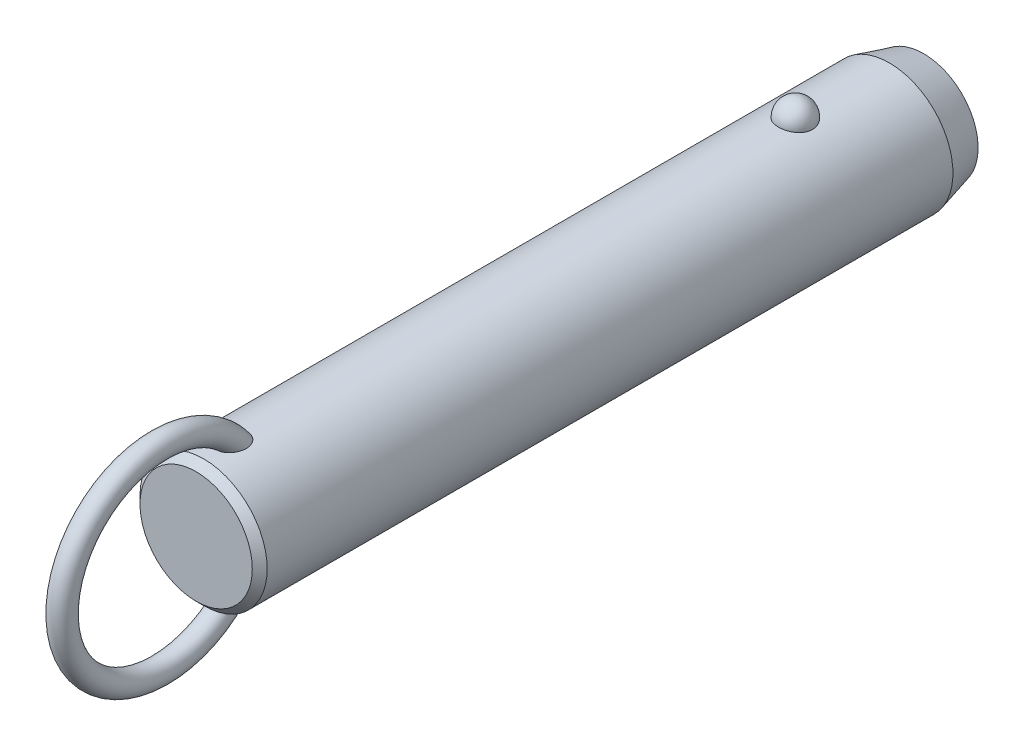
ISO-10303-21;
HEADER;
FILE_DESCRIPTION(('STEP AP214'),'2;1');
FILE_NAME('part.step','',(''),(''),'','','');
FILE_SCHEMA(('AUTOMOTIVE_DESIGN { 1 0 10303 214 1 1 1 1 }'));
ENDSEC;
DATA;
#1=APPLICATION_CONTEXT('core data for automotive mechanical design processes');
#2=APPLICATION_PROTOCOL_DEFINITION('international standard','automotive_design',2000,#1);
#3=PRODUCT_CONTEXT('',#1,'mechanical');
#4=PRODUCT('Part','Part','',(#3));
#5=PRODUCT_RELATED_PRODUCT_CATEGORY('part','',(#4));
#6=PRODUCT_DEFINITION_FORMATION('','',#4);
#7=PRODUCT_DEFINITION_CONTEXT('part definition',#1,'design');
#8=PRODUCT_DEFINITION('design','',#6,#7);
#9=PRODUCT_DEFINITION_SHAPE('','',#8);
#10=(LENGTH_UNIT() NAMED_UNIT(*) SI_UNIT(.MILLI.,.METRE.));
#11=(NAMED_UNIT(*) PLANE_ANGLE_UNIT() SI_UNIT($,.RADIAN.));
#12=(NAMED_UNIT(*) SI_UNIT($,.STERADIAN.) SOLID_ANGLE_UNIT());
#13=UNCERTAINTY_MEASURE_WITH_UNIT(LENGTH_MEASURE(1.E-05),#10,'distance_accuracy_value','');
#14=(GEOMETRIC_REPRESENTATION_CONTEXT(3) GLOBAL_UNCERTAINTY_ASSIGNED_CONTEXT((#13)) GLOBAL_UNIT_ASSIGNED_CONTEXT((#10,
#11,#12)) REPRESENTATION_CONTEXT('',''));
#15=CARTESIAN_POINT('',(0.,0.,0.));
#16=DIRECTION('',(0.,0.,1.));
#17=DIRECTION('',(1.,0.,0.));
#18=AXIS2_PLACEMENT_3D('',#15,#16,#17);
#19=CARTESIAN_POINT('',(0.,0.,88.9));
#20=DIRECTION('',(0.,0.,-1.));
#21=DIRECTION('',(-1.,0.,0.));
#22=AXIS2_PLACEMENT_3D('',#19,#20,#21);
#23=CYLINDRICAL_SURFACE('',#22,11.1);
#24=CARTESIAN_POINT('',(2.9724815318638,10.6945945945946,-3.));
#25=CARTESIAN_POINT('',(2.97247830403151,10.6945972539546,-2.83225059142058));
#26=CARTESIAN_POINT('',(2.95876598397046,10.6984356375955,-2.66445972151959));
#27=CARTESIAN_POINT('',(2.90424529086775,10.7133624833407,-2.33362381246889));
#28=CARTESIAN_POINT('',(2.8634252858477,10.7244540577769,-2.1705808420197));
#29=CARTESIAN_POINT('',(2.75573657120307,10.7526272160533,-1.85396767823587));
#30=CARTESIAN_POINT('',(2.68887937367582,10.7697061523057,-1.70039333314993));
#31=CARTESIAN_POINT('',(2.53079696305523,10.8079438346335,-1.40691598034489));
#32=CARTESIAN_POINT('',(2.43957264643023,10.8291024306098,-1.2670124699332));
#33=CARTESIAN_POINT('',(2.23458150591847,10.8732541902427,-1.00409565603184));
#34=CARTESIAN_POINT('',(2.12071295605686,10.8962553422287,-0.881162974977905));
#35=CARTESIAN_POINT('',(1.87365402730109,10.9414421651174,-0.656352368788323));
#36=CARTESIAN_POINT('',(1.74046358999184,10.9636278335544,-0.554474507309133));
#37=CARTESIAN_POINT('',(1.45872188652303,11.0046495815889,-0.374872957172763));
#38=CARTESIAN_POINT('',(1.31021276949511,11.0234944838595,-0.297085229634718));
#39=CARTESIAN_POINT('',(1.00170030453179,11.0557957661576,-0.167529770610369));
#40=CARTESIAN_POINT('',(0.841698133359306,11.0692526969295,-0.115759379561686));
#41=CARTESIAN_POINT('',(0.517607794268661,11.0890932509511,-0.0403925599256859));
#42=CARTESIAN_POINT('',(0.353633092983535,11.0955916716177,-0.0163383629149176));
#43=CARTESIAN_POINT('',(0.0238420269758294,11.1011989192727,0.0044517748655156));
#44=CARTESIAN_POINT('',(-0.141974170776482,11.1003084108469,0.00119017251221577));
#45=CARTESIAN_POINT('',(-0.468405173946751,11.0912990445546,-0.0323233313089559));
#46=CARTESIAN_POINT('',(-0.629059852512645,11.0832767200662,-0.0622147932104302));
#47=CARTESIAN_POINT('',(-0.942937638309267,11.0609962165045,-0.147645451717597));
#48=CARTESIAN_POINT('',(-1.09616062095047,11.0467379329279,-0.203185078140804));
#49=CARTESIAN_POINT('',(-1.39181061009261,11.0134071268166,-0.3387529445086));
#50=CARTESIAN_POINT('',(-1.53417383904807,10.9943086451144,-0.418913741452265));
#51=CARTESIAN_POINT('',(-1.80342160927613,10.9533667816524,-0.60144882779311));
#52=CARTESIAN_POINT('',(-1.9303046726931,10.9315231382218,-0.703825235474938));
#53=CARTESIAN_POINT('',(-2.16747598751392,10.887005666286,-0.930091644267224));
#54=CARTESIAN_POINT('',(-2.27742774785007,10.8643239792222,-1.05433291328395));
#55=CARTESIAN_POINT('',(-2.47517316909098,10.8209886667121,-1.31966633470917));
#56=CARTESIAN_POINT('',(-2.56296538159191,10.8003351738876,-1.46075958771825));
#57=CARTESIAN_POINT('',(-2.71500300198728,10.7631304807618,-1.75753646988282));
#58=CARTESIAN_POINT('',(-2.77898901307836,10.7466250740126,-1.91335887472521));
#59=CARTESIAN_POINT('',(-2.88046189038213,10.7198747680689,-2.2339152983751));
#60=CARTESIAN_POINT('',(-2.91794947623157,10.709629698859,-2.39864907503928));
#61=CARTESIAN_POINT('',(-2.96537819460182,10.6965949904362,-2.73165170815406));
#62=CARTESIAN_POINT('',(-2.97542891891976,10.693775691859,-2.89990378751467));
#63=CARTESIAN_POINT('',(-2.96804271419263,10.6958279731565,-3.235752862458));
#64=CARTESIAN_POINT('',(-2.95060646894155,10.7006993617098,-3.40334987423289));
#65=CARTESIAN_POINT('',(-2.88883358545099,10.71753912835,-3.73233906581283));
#66=CARTESIAN_POINT('',(-2.84462026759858,10.7294749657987,-3.89375610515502));
#67=CARTESIAN_POINT('',(-2.73050447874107,10.7590797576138,-4.20667949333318));
#68=CARTESIAN_POINT('',(-2.66060103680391,10.7767489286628,-4.35818546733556));
#69=CARTESIAN_POINT('',(-2.49642559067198,10.8159599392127,-4.6478542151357));
#70=CARTESIAN_POINT('',(-2.40203047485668,10.8375211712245,-4.78594458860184));
#71=CARTESIAN_POINT('',(-2.19143488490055,10.8820570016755,-5.0441038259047));
#72=CARTESIAN_POINT('',(-2.07523364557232,10.9050316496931,-5.16417205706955));
#73=CARTESIAN_POINT('',(-1.82361254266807,10.9499219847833,-5.38334833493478));
#74=CARTESIAN_POINT('',(-1.68812945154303,10.9718338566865,-5.48238464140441));
#75=CARTESIAN_POINT('',(-1.40191298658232,11.0120611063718,-5.65618873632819));
#76=CARTESIAN_POINT('',(-1.25118062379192,11.0303767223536,-5.73095813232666));
#77=CARTESIAN_POINT('',(-0.940570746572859,11.0611653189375,-5.85334725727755));
#78=CARTESIAN_POINT('',(-0.780821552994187,11.0737044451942,-5.90127578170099));
#79=CARTESIAN_POINT('',(-0.455204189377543,11.0918598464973,-5.96992976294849));
#80=CARTESIAN_POINT('',(-0.289336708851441,11.0974768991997,-5.99065827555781));
#81=CARTESIAN_POINT('',(0.0406846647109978,11.1011307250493,-6.00418773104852));
#82=CARTESIAN_POINT('',(0.204817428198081,11.099299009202,-5.99747318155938));
#83=CARTESIAN_POINT('',(0.5295530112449,11.088551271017,-5.9574031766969));
#84=CARTESIAN_POINT('',(0.69015594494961,11.0796354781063,-5.92404858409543));
#85=CARTESIAN_POINT('',(1.0027760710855,11.0557204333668,-5.83180084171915));
#86=CARTESIAN_POINT('',(1.15482001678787,11.0407414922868,-5.77299291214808));
#87=CARTESIAN_POINT('',(1.44678373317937,11.0062913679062,-5.63147366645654));
#88=CARTESIAN_POINT('',(1.58670279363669,10.9868199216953,-5.54876095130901));
#89=CARTESIAN_POINT('',(1.8527023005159,10.9451315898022,-5.36027644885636));
#90=CARTESIAN_POINT('',(1.97855158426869,10.9228788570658,-5.25418644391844));
#91=CARTESIAN_POINT('',(2.21080872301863,10.8782509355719,-5.02251354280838));
#92=CARTESIAN_POINT('',(2.31721312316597,10.8558757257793,-4.89692718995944));
#93=CARTESIAN_POINT('',(2.5094551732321,10.8130715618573,-4.62745408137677));
#94=CARTESIAN_POINT('',(2.59493284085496,10.7926798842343,-4.48330448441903));
#95=CARTESIAN_POINT('',(2.740862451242,10.7565495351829,-4.18236358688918));
#96=CARTESIAN_POINT('',(2.80132490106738,10.7408089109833,-4.02557762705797));
#97=CARTESIAN_POINT('',(2.88959070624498,10.7173718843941,-3.72475308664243));
#98=CARTESIAN_POINT('',(2.92062102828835,10.7088950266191,-3.58171216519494));
#99=CARTESIAN_POINT('',(2.96206765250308,10.6975052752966,-3.29245795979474));
#100=CARTESIAN_POINT('',(2.97248434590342,10.6945922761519,-3.14624473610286));
#101=CARTESIAN_POINT('',(2.9724815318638,10.6945945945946,-3.));
#102=B_SPLINE_CURVE_WITH_KNOTS('',3,(#24,#25,#26,#27,#28,#29,#30,#31,#32,#33,#34,#35,#36,#37,
#38,#39,#40,#41,#42,#43,#44,#45,#46,#47,#48,#49,#50,#51,#52,#53,#54,#55,#56,#57,#58,#59,#60,#61,
#62,#63,#64,#65,#66,#67,#68,#69,#70,#71,#72,#73,#74,#75,#76,#77,#78,#79,#80,#81,#82,#83,#84,#85,
#86,#87,#88,#89,#90,#91,#92,#93,#94,#95,#96,#97,#98,#99,#100,#101),.UNSPECIFIED.,.T.,.F.,(4,2,2,
2,2,2,2,2,2,2,2,2,2,2,2,2,2,2,2,2,2,2,2,2,2,2,2,2,2,2,2,2,2,2,2,2,2,2,4),(0.,0.502722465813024,
1.00566079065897,1.5083769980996,2.01107471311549,2.51608392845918,3.02109467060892,
3.52475118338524,4.02835620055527,4.523518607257,5.0186364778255,5.50715297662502,
5.9956776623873,6.48688002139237,6.97812923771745,7.47814366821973,7.9781907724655,
8.48353712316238,8.9888697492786,9.49218093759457,9.99547960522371,10.4964777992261,
10.997494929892,11.5010810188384,12.0046847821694,12.5099796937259,13.0152411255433,
13.5145635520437,14.0138298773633,14.5043200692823,14.9947943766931,15.4836390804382,
15.9725123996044,16.4685040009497,16.9645836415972,17.4686765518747,17.972557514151,
18.410841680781,18.849117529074),.UNSPECIFIED.);
#103=CARTESIAN_POINT('',(2.9724815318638,10.6945945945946,-3.));
#104=VERTEX_POINT('',#103);
#105=EDGE_CURVE('E41',#104,#104,#102,.T.);
#106=ORIENTED_EDGE('',*,*,#105,.T.);
#107=EDGE_LOOP('',(#106));
#108=FACE_BOUND('',#107,.T.);
#109=CARTESIAN_POINT('',(0.,0.,100.3));
#110=DIRECTION('',(0.,0.,1.));
#111=DIRECTION('',(1.,0.,0.));
#112=AXIS2_PLACEMENT_3D('',#109,#110,#111);
#113=CIRCLE('',#112,11.1);
#114=CARTESIAN_POINT('',(11.1,0.,100.3));
#115=VERTEX_POINT('',#114);
#116=EDGE_CURVE('E10',#115,#115,#113,.F.);
#117=ORIENTED_EDGE('',*,*,#116,.T.);
#118=EDGE_LOOP('',(#117));
#119=FACE_BOUND('',#118,.T.);
#120=CARTESIAN_POINT('',(-0.564520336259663,-11.0856356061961,92.5578154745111));
#121=CARTESIAN_POINT('',(-0.667202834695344,-11.0804062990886,92.5912839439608));
#122=CARTESIAN_POINT('',(-0.766875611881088,-11.0738877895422,92.6338357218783));
#123=CARTESIAN_POINT('',(-0.957284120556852,-11.0590576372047,92.7354190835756));
#124=CARTESIAN_POINT('',(-1.04801616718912,-11.0507452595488,92.7944574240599));
#125=CARTESIAN_POINT('',(-1.21800952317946,-11.0333016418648,92.9265293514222));
#126=CARTESIAN_POINT('',(-1.29730805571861,-11.0241732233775,92.9995156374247));
#127=CARTESIAN_POINT('',(-1.44337665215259,-11.0060026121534,93.1570374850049));
#128=CARTESIAN_POINT('',(-1.51014622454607,-10.9969604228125,93.2415734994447));
#129=CARTESIAN_POINT('',(-1.63454620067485,-10.9791841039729,93.4255213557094));
#130=CARTESIAN_POINT('',(-1.69127003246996,-10.9705107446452,93.5255493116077));
#131=CARTESIAN_POINT('',(-1.78980785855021,-10.9548648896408,93.7327902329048));
#132=CARTESIAN_POINT('',(-1.83161214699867,-10.9478935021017,93.8400078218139));
#133=CARTESIAN_POINT('',(-1.91557028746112,-10.9335803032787,94.1054080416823));
#134=CARTESIAN_POINT('',(-1.95040620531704,-10.9273269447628,94.2659806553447));
#135=CARTESIAN_POINT('',(-1.99388326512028,-10.9194709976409,94.5906977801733));
#136=CARTESIAN_POINT('',(-2.00248051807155,-10.9178762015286,94.7548478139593));
#137=CARTESIAN_POINT('',(-1.99551615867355,-10.9191578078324,95.1246504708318));
#138=CARTESIAN_POINT('',(-1.9732206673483,-10.9232807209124,95.3301911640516));
#139=CARTESIAN_POINT('',(-1.91529761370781,-10.9335244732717,95.633595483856));
#140=CARTESIAN_POINT('',(-1.8918457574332,-10.9376266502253,95.7340883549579));
#141=CARTESIAN_POINT('',(-1.83700674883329,-10.9469720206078,95.932855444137));
#142=CARTESIAN_POINT('',(-1.80562070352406,-10.9522150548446,96.0311299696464));
#143=CARTESIAN_POINT('',(-1.73463055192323,-10.9636837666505,96.2259148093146));
#144=CARTESIAN_POINT('',(-1.69493416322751,-10.9699202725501,96.3223907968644));
#145=CARTESIAN_POINT('',(-1.60745141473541,-10.9830806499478,96.5116262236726));
#146=CARTESIAN_POINT('',(-1.55966150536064,-10.9900048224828,96.6043840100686));
#147=CARTESIAN_POINT('',(-1.45591812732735,-11.0042280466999,96.7846907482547));
#148=CARTESIAN_POINT('',(-1.40000013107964,-11.0115253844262,96.8722601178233));
#149=CARTESIAN_POINT('',(-1.27937470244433,-11.0261911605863,97.0410298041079));
#150=CARTESIAN_POINT('',(-1.21467835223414,-11.0335594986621,97.1222379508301));
#151=CARTESIAN_POINT('',(-1.08218150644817,-11.0473027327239,97.2690010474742));
#152=CARTESIAN_POINT('',(-1.01522633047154,-11.0537063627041,97.335309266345));
#153=CARTESIAN_POINT('',(-0.872952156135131,-11.065850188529,97.4583780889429));
#154=CARTESIAN_POINT('',(-0.797642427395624,-11.0715911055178,97.5151491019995));
#155=CARTESIAN_POINT('',(-0.651396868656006,-11.081071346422,97.6075155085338));
#156=CARTESIAN_POINT('',(-0.581712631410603,-11.0849841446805,97.6450491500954));
#157=CARTESIAN_POINT('',(-0.437066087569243,-11.0916271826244,97.7082594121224));
#158=CARTESIAN_POINT('',(-0.362109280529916,-11.0943586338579,97.7339481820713));
#159=CARTESIAN_POINT('',(-0.207828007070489,-11.0983242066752,97.771117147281));
#160=CARTESIAN_POINT('',(-0.128467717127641,-11.0995432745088,97.7824545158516));
#161=CARTESIAN_POINT('',(0.0309101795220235,-11.1002423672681,97.7889658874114));
#162=CARTESIAN_POINT('',(0.110927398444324,-11.0997233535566,97.7841488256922));
#163=CARTESIAN_POINT('',(0.256406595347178,-11.097240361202,97.7609599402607));
#164=CARTESIAN_POINT('',(0.32223577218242,-11.0955074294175,97.7447543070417));
#165=CARTESIAN_POINT('',(0.450635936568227,-11.0910350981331,97.7026008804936));
#166=CARTESIAN_POINT('',(0.513205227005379,-11.0882951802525,97.6766480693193));
#167=CARTESIAN_POINT('',(0.662626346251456,-11.0805620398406,97.6026073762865));
#168=CARTESIAN_POINT('',(0.747127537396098,-11.0751144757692,97.5498452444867));
#169=CARTESIAN_POINT('',(0.906756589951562,-11.0631932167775,97.4317206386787));
#170=CARTESIAN_POINT('',(0.981859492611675,-11.0567168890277,97.3663257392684));
#171=CARTESIAN_POINT('',(1.10712207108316,-11.0447856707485,97.2422633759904));
#172=CARTESIAN_POINT('',(1.15909566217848,-11.0394280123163,97.1853831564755));
#173=CARTESIAN_POINT('',(1.25791923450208,-11.0286040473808,97.0673271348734));
#174=CARTESIAN_POINT('',(1.30476642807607,-11.0231376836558,97.0061490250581));
#175=CARTESIAN_POINT('',(1.43818612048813,-11.0068027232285,96.817305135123));
#176=CARTESIAN_POINT('',(1.51751767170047,-10.9960104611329,96.6844531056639));
#177=CARTESIAN_POINT('',(1.63597546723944,-10.9788847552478,96.4531371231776));
#178=CARTESIAN_POINT('',(1.67988876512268,-10.9722190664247,96.3570530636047));
#179=CARTESIAN_POINT('',(1.75953241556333,-10.9597298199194,96.1614311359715));
#180=CARTESIAN_POINT('',(1.79525967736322,-10.9539065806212,96.0618919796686));
#181=CARTESIAN_POINT('',(1.85844731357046,-10.9433632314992,95.8602111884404));
#182=CARTESIAN_POINT('',(1.88591073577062,-10.9386427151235,95.7580705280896));
#183=CARTESIAN_POINT('',(1.93234324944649,-10.9305350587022,95.5518191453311));
#184=CARTESIAN_POINT('',(1.95131065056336,-10.9271481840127,95.4477080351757));
#185=CARTESIAN_POINT('',(1.99040203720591,-10.9201183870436,95.1654588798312));
#186=CARTESIAN_POINT('',(2.00221217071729,-10.9179256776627,94.986037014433));
#187=CARTESIAN_POINT('',(1.99711676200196,-10.9188636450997,94.6277133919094));
#188=CARTESIAN_POINT('',(1.98026150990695,-10.9219849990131,94.448811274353));
#189=CARTESIAN_POINT('',(1.92151657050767,-10.9324473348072,94.1364514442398));
#190=CARTESIAN_POINT('',(1.88605081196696,-10.9386915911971,94.0017594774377));
#191=CARTESIAN_POINT('',(1.7939302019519,-10.9541780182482,93.7399669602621));
#192=CARTESIAN_POINT('',(1.73729868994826,-10.9634168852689,93.6128582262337));
#193=CARTESIAN_POINT('',(1.612370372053,-10.9824218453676,93.3894184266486));
#194=CARTESIAN_POINT('',(1.54715374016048,-10.9918945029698,93.2913455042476));
#195=CARTESIAN_POINT('',(1.40127026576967,-11.0114415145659,93.1074341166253));
#196=CARTESIAN_POINT('',(1.32060742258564,-11.0215157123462,93.0215924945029));
#197=CARTESIAN_POINT('',(1.14474787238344,-11.041168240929,92.8651630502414));
#198=CARTESIAN_POINT('',(1.04947805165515,-11.0507437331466,92.7946565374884));
#199=CARTESIAN_POINT('',(0.847278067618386,-11.0680789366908,92.672640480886));
#200=CARTESIAN_POINT('',(0.74035174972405,-11.0758392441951,92.6211246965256));
#201=CARTESIAN_POINT('',(0.52928931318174,-11.0878275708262,92.5434852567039));
#202=CARTESIAN_POINT('',(0.425895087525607,-11.0923259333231,92.5153777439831));
#203=CARTESIAN_POINT('',(0.215723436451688,-11.0984001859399,92.4777038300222));
#204=CARTESIAN_POINT('',(0.108947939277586,-11.0999777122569,92.4681270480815));
#205=CARTESIAN_POINT('',(-0.0938962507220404,-11.1000196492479,92.4678773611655));
#206=CARTESIAN_POINT('',(-0.189967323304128,-11.0987797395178,92.4754089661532));
#207=CARTESIAN_POINT('',(-0.379657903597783,-11.0939111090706,92.5055079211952));
#208=CARTESIAN_POINT('',(-0.473277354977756,-11.0902823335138,92.5280756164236));
#209=CARTESIAN_POINT('',(-0.564520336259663,-11.0856356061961,92.5578154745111));
#210=B_SPLINE_CURVE_WITH_KNOTS('',3,(#120,#121,#122,#123,#124,#125,#126,#127,#128,#129,#130,
#131,#132,#133,#134,#135,#136,#137,#138,#139,#140,#141,#142,#143,#144,#145,#146,#147,#148,#149,
#150,#151,#152,#153,#154,#155,#156,#157,#158,#159,#160,#161,#162,#163,#164,#165,#166,#167,#168,
#169,#170,#171,#172,#173,#174,#175,#176,#177,#178,#179,#180,#181,#182,#183,#184,#185,#186,#187,
#188,#189,#190,#191,#192,#193,#194,#195,#196,#197,#198,#199,#200,#201,#202,#203,#204,#205,#206,
#207,#208,#209),.UNSPECIFIED.,.T.,.F.,(4,2,2,2,2,2,2,2,2,2,2,2,2,2,2,2,2,2,2,2,2,2,2,2,2,2,2,2,
2,2,2,2,2,2,2,2,2,2,2,2,2,2,2,2,4),(0.,0.323999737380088,0.648132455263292,0.971184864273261,
1.29424994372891,1.6388623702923,1.98369857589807,2.47426059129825,2.96564271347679,
3.58257396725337,3.89215258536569,4.20168803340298,4.51486273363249,4.82817514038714,
5.14015911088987,5.45175282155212,5.73442856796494,6.01679375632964,6.25364580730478,
6.49025437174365,6.7291996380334,6.96801276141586,7.17061258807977,7.37331685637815,
7.67094989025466,7.96935728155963,8.20075067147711,8.43226927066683,8.89581623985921,
9.21306533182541,9.53043400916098,9.84768549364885,10.1650000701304,10.70229304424,
11.2386443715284,11.6553390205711,12.0715755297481,12.4245637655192,12.7774607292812,
13.1321855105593,13.4867936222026,13.8068771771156,14.1267813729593,14.4146787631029,
14.7025827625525),.UNSPECIFIED.);
#211=CARTESIAN_POINT('',(-0.564520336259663,-11.0856356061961,92.5578154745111));
#212=VERTEX_POINT('',#211);
#213=EDGE_CURVE('E59',#212,#212,#210,.T.);
#214=ORIENTED_EDGE('',*,*,#213,.T.);
#215=EDGE_LOOP('',(#214));
#216=FACE_BOUND('',#215,.T.);
#217=CARTESIAN_POINT('',(-0.564520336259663,11.0856356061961,92.5578154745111));
#218=CARTESIAN_POINT('',(-0.468542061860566,11.0905203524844,92.5265456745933));
#219=CARTESIAN_POINT('',(-0.36979381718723,11.0942886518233,92.5031576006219));
#220=CARTESIAN_POINT('',(-0.169555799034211,11.0991586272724,92.4730858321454));
#221=CARTESIAN_POINT('',(-0.0680604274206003,11.1002543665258,92.4664393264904));
#222=CARTESIAN_POINT('',(0.134549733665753,11.099646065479,92.4701579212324));
#223=CARTESIAN_POINT('',(0.235664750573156,11.0979441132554,92.4805103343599));
#224=CARTESIAN_POINT('',(0.43463240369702,11.0919342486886,92.5178318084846));
#225=CARTESIAN_POINT('',(0.532486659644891,11.0876276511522,92.5447924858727));
#226=CARTESIAN_POINT('',(0.722445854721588,11.0768742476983,92.6144096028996));
#227=CARTESIAN_POINT('',(0.814543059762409,11.0704246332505,92.6570866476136));
#228=CARTESIAN_POINT('',(0.99056508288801,11.0560659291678,92.7566487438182));
#229=CARTESIAN_POINT('',(1.07448844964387,11.048156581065,92.8135363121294));
#230=CARTESIAN_POINT('',(1.23562672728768,11.0313221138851,92.9422106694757));
#231=CARTESIAN_POINT('',(1.31242684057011,11.0223686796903,93.0145117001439));
#232=CARTESIAN_POINT('',(1.45398030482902,11.0045918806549,93.1700425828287));
#233=CARTESIAN_POINT('',(1.51873073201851,10.9957685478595,93.2532750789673));
#234=CARTESIAN_POINT('',(1.64107232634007,10.9782087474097,93.4363842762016));
#235=CARTESIAN_POINT('',(1.69743176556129,10.9695572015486,93.5370893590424));
#236=CARTESIAN_POINT('',(1.79515063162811,10.9539887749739,93.7456264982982));
#237=CARTESIAN_POINT('',(1.83649966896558,10.9470730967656,93.8534634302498));
#238=CARTESIAN_POINT('',(1.91931148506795,10.9329211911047,94.1203995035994));
#239=CARTESIAN_POINT('',(1.9534010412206,10.9267904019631,94.2818612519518));
#240=CARTESIAN_POINT('',(1.99526195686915,10.9192174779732,94.6082163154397));
#241=CARTESIAN_POINT('',(2.00298989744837,10.9177830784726,94.7731148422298));
#242=CARTESIAN_POINT('',(1.99396251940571,10.9194420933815,95.1441006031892));
#243=CARTESIAN_POINT('',(1.97050829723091,10.923774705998,95.3500387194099));
#244=CARTESIAN_POINT('',(1.91079643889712,10.9343131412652,95.6539019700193));
#245=CARTESIAN_POINT('',(1.88673702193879,10.9385106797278,95.7545296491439));
#246=CARTESIAN_POINT('',(1.83065508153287,10.9480376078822,95.9535107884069));
#247=CARTESIAN_POINT('',(1.79863369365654,10.9533668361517,96.051864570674));
#248=CARTESIAN_POINT('',(1.72633365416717,10.9649954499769,96.246720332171));
#249=CARTESIAN_POINT('',(1.68596409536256,10.9713053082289,96.3431879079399));
#250=CARTESIAN_POINT('',(1.59707998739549,10.9845964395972,96.5323233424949));
#251=CARTESIAN_POINT('',(1.54856169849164,10.9915780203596,96.6249894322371));
#252=CARTESIAN_POINT('',(1.44330168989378,11.0058935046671,96.8049752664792));
#253=CARTESIAN_POINT('',(1.38659749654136,11.0132257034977,96.892316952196));
#254=CARTESIAN_POINT('',(1.26431158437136,11.0279330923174,97.0604563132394));
#255=CARTESIAN_POINT('',(1.19874160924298,11.0353082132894,97.1412624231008));
#256=CARTESIAN_POINT('',(1.06542088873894,11.0489310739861,97.2859856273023));
#257=CARTESIAN_POINT('',(0.998640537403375,11.0552153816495,97.350784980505));
#258=CARTESIAN_POINT('',(0.856896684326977,11.0671032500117,97.4708462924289));
#259=CARTESIAN_POINT('',(0.781942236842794,11.0727075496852,97.5261186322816));
#260=CARTESIAN_POINT('',(0.636276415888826,11.081949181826,97.6159721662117));
#261=CARTESIAN_POINT('',(0.566755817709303,11.0857572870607,97.6524410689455));
#262=CARTESIAN_POINT('',(0.422602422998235,11.0921860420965,97.7135333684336));
#263=CARTESIAN_POINT('',(0.347974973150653,11.0948079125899,97.7381689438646));
#264=CARTESIAN_POINT('',(0.194593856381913,11.0985608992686,97.7733233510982));
#265=CARTESIAN_POINT('',(0.115807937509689,11.0996777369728,97.7837069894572));
#266=CARTESIAN_POINT('',(-0.0422499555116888,11.1002003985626,97.7885747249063));
#267=CARTESIAN_POINT('',(-0.121521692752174,11.09960699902,97.783066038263));
#268=CARTESIAN_POINT('',(-0.266046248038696,11.0970123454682,97.7588271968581));
#269=CARTESIAN_POINT('',(-0.331661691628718,11.0952283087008,97.7421356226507));
#270=CARTESIAN_POINT('',(-0.459588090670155,11.0906663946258,97.6991117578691));
#271=CARTESIAN_POINT('',(-0.521897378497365,11.0878880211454,97.672774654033));
#272=CARTESIAN_POINT('',(-0.671446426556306,11.0800342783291,97.5975130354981));
#273=CARTESIAN_POINT('',(-0.756250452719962,11.0744969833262,97.5438182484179));
#274=CARTESIAN_POINT('',(-0.916349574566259,11.0624045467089,97.4238029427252));
#275=CARTESIAN_POINT('',(-0.99161892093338,11.0558467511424,97.3574493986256));
#276=CARTESIAN_POINT('',(-1.11713140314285,11.0437783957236,97.2316335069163));
#277=CARTESIAN_POINT('',(-1.16920539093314,11.0383619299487,97.1739524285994));
#278=CARTESIAN_POINT('',(-1.26817476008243,11.02743010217,97.0542809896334));
#279=CARTESIAN_POINT('',(-1.31506731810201,11.0219146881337,96.9922883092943));
#280=CARTESIAN_POINT('',(-1.40399813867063,11.0109399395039,96.8647843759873));
#281=CARTESIAN_POINT('',(-1.4460286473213,11.0054807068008,96.7992677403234));
#282=CARTESIAN_POINT('',(-1.52538779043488,10.9947621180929,96.6654223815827));
#283=CARTESIAN_POINT('',(-1.56271516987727,10.9895028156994,96.5970929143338));
#284=CARTESIAN_POINT('',(-1.64537943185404,10.9774790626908,96.4332101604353));
#285=CARTESIAN_POINT('',(-1.68879497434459,10.9708503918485,96.3366735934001));
#286=CARTESIAN_POINT('',(-1.76740738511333,10.9584602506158,96.1402369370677));
#287=CARTESIAN_POINT('',(-1.80260120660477,10.95269910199,96.0403356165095));
#288=CARTESIAN_POINT('',(-1.86468657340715,10.9423003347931,95.8379663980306));
#289=CARTESIAN_POINT('',(-1.89158164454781,10.9376622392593,95.7354996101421));
#290=CARTESIAN_POINT('',(-1.93682458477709,10.9297405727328,95.5286429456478));
#291=CARTESIAN_POINT('',(-1.9551708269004,10.9264572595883,95.4242527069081));
#292=CARTESIAN_POINT('',(-1.99232562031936,10.9197647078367,95.1426287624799));
#293=CARTESIAN_POINT('',(-2.00294603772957,10.9177914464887,94.9641857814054));
#294=CARTESIAN_POINT('',(-1.99566675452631,10.9191290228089,94.6079962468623));
#295=CARTESIAN_POINT('',(-1.97781651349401,10.9224306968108,94.4302490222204));
#296=CARTESIAN_POINT('',(-1.91747214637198,10.9331592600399,94.1197921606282));
#297=CARTESIAN_POINT('',(-1.88131022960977,10.9395108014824,93.985825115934));
#298=CARTESIAN_POINT('',(-1.7879038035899,10.9551659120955,93.7255975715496));
#299=CARTESIAN_POINT('',(-1.7306830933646,10.9644661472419,93.5993285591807));
#300=CARTESIAN_POINT('',(-1.60475573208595,10.9835398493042,93.3774156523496));
#301=CARTESIAN_POINT('',(-1.53908879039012,10.9930297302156,93.2800265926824));
#302=CARTESIAN_POINT('',(-1.39238608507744,11.0125708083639,93.0975250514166));
#303=CARTESIAN_POINT('',(-1.31135150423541,11.0226219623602,93.0124116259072));
#304=CARTESIAN_POINT('',(-1.14382035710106,11.0411991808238,92.8652994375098));
#305=CARTESIAN_POINT('',(-1.05858500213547,11.0497792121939,92.8018693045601));
#306=CARTESIAN_POINT('',(-0.878723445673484,11.0655285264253,92.6902505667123));
#307=CARTESIAN_POINT('',(-0.784123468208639,11.0727015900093,92.6420208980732));
#308=CARTESIAN_POINT('',(-0.646163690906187,11.0812501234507,92.586023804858));
#309=CARTESIAN_POINT('',(-0.605595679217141,11.0835451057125,92.5711978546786));
#310=CARTESIAN_POINT('',(-0.564520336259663,11.0856356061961,92.5578154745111));
#311=B_SPLINE_CURVE_WITH_KNOTS('',3,(#217,#218,#219,#220,#221,#222,#223,#224,#225,#226,#227,
#228,#229,#230,#231,#232,#233,#234,#235,#236,#237,#238,#239,#240,#241,#242,#243,#244,#245,#246,
#247,#248,#249,#250,#251,#252,#253,#254,#255,#256,#257,#258,#259,#260,#261,#262,#263,#264,#265,
#266,#267,#268,#269,#270,#271,#272,#273,#274,#275,#276,#277,#278,#279,#280,#281,#282,#283,#284,
#285,#286,#287,#288,#289,#290,#291,#292,#293,#294,#295,#296,#297,#298,#299,#300,#301,#302,#303,
#304,#305,#306,#307,#308,#309,#310),.UNSPECIFIED.,.T.,.F.,(4,2,2,2,2,2,2,2,2,2,2,2,2,2,2,2,2,2,
2,2,2,2,2,2,2,2,2,2,2,2,2,2,2,2,2,2,2,2,2,2,2,2,2,2,2,2,4),(0.,0.303061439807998,
0.606795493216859,0.910302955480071,1.21365733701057,1.51741085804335,1.82121821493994,
2.13745205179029,2.45376252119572,2.79958678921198,3.14564996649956,3.63832391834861,
4.13180893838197,4.75031912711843,5.06071926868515,5.37107516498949,5.68500772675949,
5.99908475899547,6.31176519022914,6.62403542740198,6.90315673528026,7.1819719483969,
7.41687778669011,7.65154134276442,7.88841587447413,8.12518286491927,8.3275284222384,
8.52997509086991,8.82986421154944,9.13054668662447,9.36393502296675,9.59744991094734,
9.83133221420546,10.0652767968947,10.383032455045,10.7009056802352,11.0186436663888,
11.3364420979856,11.8705925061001,12.4038159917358,12.8189662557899,13.2336487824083,
13.5857049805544,13.9377340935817,14.2561354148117,14.5736690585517,14.7033687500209),.UNSPECIFIED.);
#312=CARTESIAN_POINT('',(-0.564520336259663,11.0856356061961,92.5578154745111));
#313=VERTEX_POINT('',#312);
#314=EDGE_CURVE('E66',#313,#313,#311,.T.);
#315=ORIENTED_EDGE('',*,*,#314,.T.);
#316=EDGE_LOOP('',(#315));
#317=FACE_BOUND('',#316,.T.);
#318=CARTESIAN_POINT('',(0.,0.,-19.3999999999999));
#319=DIRECTION('',(0.,0.,-1.));
#320=DIRECTION('',(-1.,0.,0.));
#321=AXIS2_PLACEMENT_3D('',#318,#319,#320);
#322=CIRCLE('',#321,11.1);
#323=CARTESIAN_POINT('',(-11.1,0.,-19.3999999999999));
#324=VERTEX_POINT('',#323);
#325=EDGE_CURVE('E56',#324,#324,#322,.F.);
#326=ORIENTED_EDGE('',*,*,#325,.T.);
#327=EDGE_LOOP('',(#326));
#328=FACE_BOUND('',#327,.T.);
#329=ADVANCED_FACE('F37',(#108,#119,#216,#317,#328),#23,.T.);
#330=CARTESIAN_POINT('',(0.,0.,-25.4));
#331=DIRECTION('',(0.,0.,-1.));
#332=DIRECTION('',(-1.,0.,0.));
#333=AXIS2_PLACEMENT_3D('',#330,#331,#332);
#334=PLANE('',#333);
#335=CARTESIAN_POINT('',(0.,0.,-25.4));
#336=DIRECTION('',(0.,0.,-1.));
#337=DIRECTION('',(-1.,0.,0.));
#338=AXIS2_PLACEMENT_3D('',#335,#336,#337);
#339=CIRCLE('',#338,9.49230484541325);
#340=CARTESIAN_POINT('',(-9.49230484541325,0.,-25.4));
#341=VERTEX_POINT('',#340);
#342=EDGE_CURVE('E65',#341,#341,#339,.T.);
#343=ORIENTED_EDGE('',*,*,#342,.T.);
#344=EDGE_LOOP('',(#343));
#345=FACE_BOUND('',#344,.T.);
#346=ADVANCED_FACE('F84',(#345),#334,.T.);
#347=CARTESIAN_POINT('',(0.,0.,-25.4));
#348=DIRECTION('',(0.,0.,1.));
#349=DIRECTION('',(1.,0.,0.));
#350=AXIS2_PLACEMENT_3D('',#347,#348,#349);
#351=CONICAL_SURFACE('',#350,9.49230484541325,0.261799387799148);
#352=ORIENTED_EDGE('',*,*,#325,.F.);
#353=EDGE_LOOP('',(#352));
#354=FACE_BOUND('',#353,.T.);
#355=ORIENTED_EDGE('',*,*,#342,.F.);
#356=EDGE_LOOP('',(#355));
#357=FACE_BOUND('',#356,.T.);
#358=ADVANCED_FACE('F82',(#354,#357),#351,.T.);
#359=CARTESIAN_POINT('',(0.,0.,101.6));
#360=DIRECTION('',(0.,0.,1.));
#361=DIRECTION('',(1.,0.,0.));
#362=AXIS2_PLACEMENT_3D('',#359,#360,#361);
#363=PLANE('',#362);
#364=CARTESIAN_POINT('',(0.,0.,101.6));
#365=DIRECTION('',(0.,0.,1.));
#366=DIRECTION('',(1.,0.,0.));
#367=AXIS2_PLACEMENT_3D('',#364,#365,#366);
#368=CIRCLE('',#367,9.79999999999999);
#369=CARTESIAN_POINT('',(9.79999999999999,0.,101.6));
#370=VERTEX_POINT('',#369);
#371=EDGE_CURVE('E50',#370,#370,#368,.T.);
#372=ORIENTED_EDGE('',*,*,#371,.T.);
#373=EDGE_LOOP('',(#372));
#374=FACE_BOUND('',#373,.T.);
#375=ADVANCED_FACE('F76',(#374),#363,.T.);
#376=CARTESIAN_POINT('',(0.,0.,107.95));
#377=DIRECTION('',(1.,0.,0.));
#378=DIRECTION('',(0.,0.,-1.));
#379=AXIS2_PLACEMENT_3D('',#376,#377,#378);
#380=TOROIDAL_SURFACE('',#379,17.05,2.);
#381=ORIENTED_EDGE('',*,*,#314,.F.);
#382=EDGE_LOOP('',(#381));
#383=FACE_BOUND('',#382,.T.);
#384=ORIENTED_EDGE('',*,*,#213,.F.);
#385=EDGE_LOOP('',(#384));
#386=FACE_BOUND('',#385,.T.);
#387=ADVANCED_FACE('F72',(#383,#386),#380,.T.);
#388=CARTESIAN_POINT('',(0.,0.,101.6));
#389=DIRECTION('',(0.,0.,-1.));
#390=DIRECTION('',(-1.,0.,0.));
#391=AXIS2_PLACEMENT_3D('',#388,#389,#390);
#392=CONICAL_SURFACE('',#391,9.79999999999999,0.785398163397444);
#393=ORIENTED_EDGE('',*,*,#116,.F.);
#394=EDGE_LOOP('',(#393));
#395=FACE_BOUND('',#394,.T.);
#396=ORIENTED_EDGE('',*,*,#371,.F.);
#397=EDGE_LOOP('',(#396));
#398=FACE_BOUND('',#397,.T.);
#399=ADVANCED_FACE('F39',(#395,#398),#392,.T.);
#400=CARTESIAN_POINT('',(0.,11.1,-3.));
#401=DIRECTION('',(0.,1.,0.));
#402=DIRECTION('',(0.,0.,-1.));
#403=AXIS2_PLACEMENT_3D('',#400,#401,#402);
#404=SPHERICAL_SURFACE('',#403,3.);
#405=ORIENTED_EDGE('',*,*,#105,.F.);
#406=EDGE_LOOP('',(#405));
#407=FACE_BOUND('',#406,.T.);
#408=ADVANCED_FACE('F78',(#407),#404,.T.);
#409=CLOSED_SHELL('',(#329,#346,#358,#375,#387,#399,#408));
#410=MANIFOLD_SOLID_BREP('B2',#409);
#411=ADVANCED_BREP_SHAPE_REPRESENTATION('',(#18,#410),#14);
#412=SHAPE_DEFINITION_REPRESENTATION(#9,#411);
ENDSEC;
END-ISO-10303-21;
